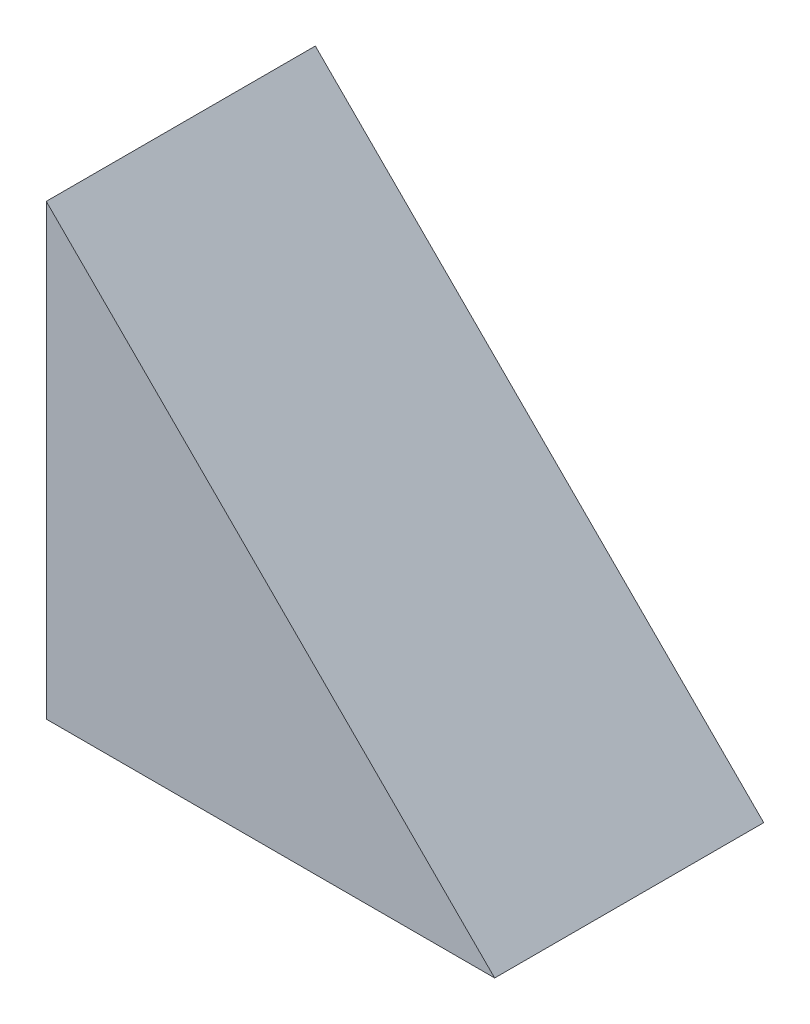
from build123d import *

# Parameters (mm, degrees)
BOSS_EXTRUDE1_DEPTH = 12


with BuildPart() as part:
    # Sketch1 → Boss-Extrude1 (new body)
    with BuildSketch(Plane.XY):
        Polygon((0, 0), (0, 20), (20, 0), align=None)
    extrude(amount=BOSS_EXTRUDE1_DEPTH)


solid = part.part
